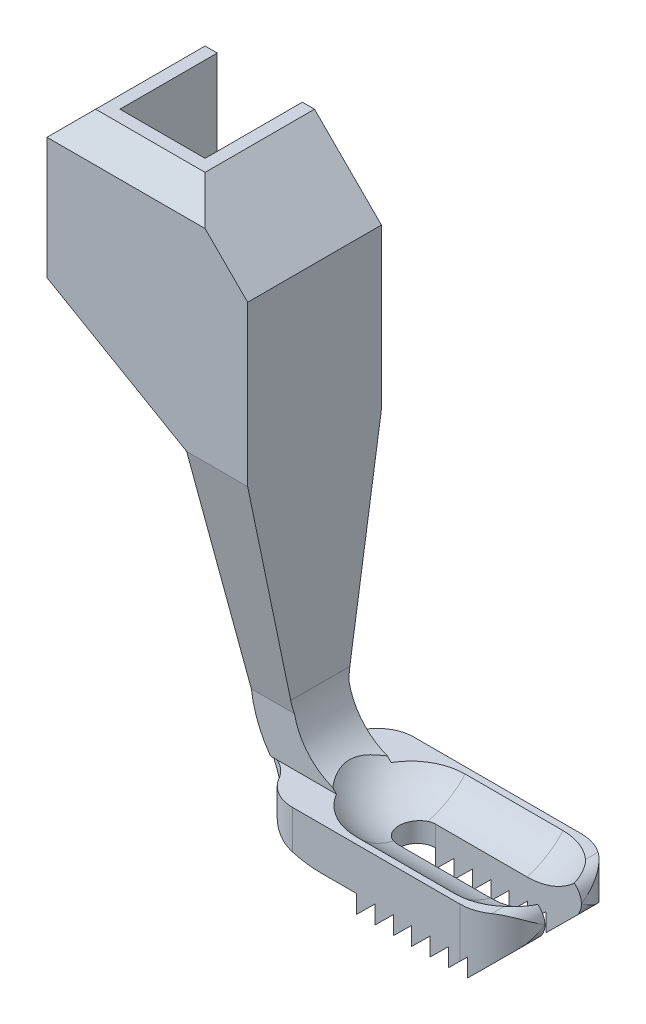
from build123d import *

# Parameters (mm, degrees)
LINEAR_AUSTRAGEN1_DEPTH       = 10
LINEAR_AUSTRAGEN2_DEPTH       = 19.662561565
LINEAR_AUSTRAGEN8_DEPTH       = 19.662561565
LINEAR_AUSTRAGEN9_DEPTH       = 2.25
LINEAR_AUSTRAGEN9_DEPTH_BACK  = 2.25
LINEAR_AUSTRAGEN10_DEPTH      = 5.5
LINEAR_AUSTRAGEN10_DEPTH_BACK = 5.5
LINEAR_AUSTRAGEN11_DEPTH      = 43.285727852
LINEAR_AUSTRAGEN11_DEPTH_BACK = 43.285727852
SKIZZE13_W                    = 7
SKIZZE13_H                    = 8
LINEAR_AUSTRAGEN13_DEPTH      = 52.625327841
FASE1_SIZE                    = 2


with BuildPart() as part:
    # Skizze1 → Linear austragen1 (new body)
    with BuildSketch(Plane.XY):
        with BuildLine():
            Line((0, -8.5), (2.942931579, -8.5))
            Line((2.942931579, -8.5), (2.942931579, -10))
            Line((2.942931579, -10), (4.458843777, -8.5))
            Line((4.458843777, -8.5), (4.458843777, -10))
            Line((4.458843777, -10), (5.974755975, -8.5))
            Line((5.974755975, -8.5), (5.974755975, -10))
            Line((5.974755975, -10), (7.490668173, -8.5))
            Line((7.490668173, -8.5), (7.490668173, -10))
            Line((7.490668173, -10), (9.006580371, -8.5))
            Line((9.006580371, -8.5), (9.006580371, -10))
            Line((9.006580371, -10), (10.522492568, -8.5))
            Line((10.522492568, -8.5), (10.522492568, -10))
            Line((10.522492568, -10), (12.038404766, -8.5))
            Line((12.038404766, -8.5), (12.038404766, -10))
            Line((12.038404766, -10), (14.497980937, -7.566241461))
            ThreePointArc((14.497980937, -7.566241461), (14.830260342, -5.929632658), (13.442931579, -5))
            Line((13.442931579, -5), (0, -5))
            Line((0, -5), (-6.873863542, -5))
            ThreePointArc((-6.873863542, -5), (-3.856812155, -7.574628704), (0, -8.5))
        make_face()
    extrude(amount=LINEAR_AUSTRAGEN1_DEPTH)

    # Skizze2 → Linear austragen2 (cut, through all)
    with BuildSketch(Plane(origin=(0, -5, 0), x_dir=(1, 0, 0), z_dir=(0, 1, 0))):
        with BuildLine():
            Line((14.942931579, -3.5), (2.942931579, -3.5))
            ThreePointArc((2.942931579, -3.5), (1.442931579, -5), (2.942931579, -6.5))
            Line((2.942931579, -6.5), (14.942931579, -6.5))
            Line((14.942931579, -6.5), (14.942931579, -3.5))
        make_face()
    extrude(amount=-LINEAR_AUSTRAGEN2_DEPTH, mode=Mode.SUBTRACT)

    # Skizze3 → Linear austragen8 (cut, through all)
    with BuildSketch(Plane(origin=(0, -5, 0), x_dir=(1, 0, 0), z_dir=(0, 1, 0))):
        with BuildLine():
            Line((14.942931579, 0), (14.942931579, -3.5))
            ThreePointArc((14.942931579, -3.5), (13.917805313, -1.025126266), (11.442931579, 0))
            Line((11.442931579, 0), (14.942931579, 0))
        make_face()
        with BuildLine():
            Line((-6.873863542, -10), (-6.873863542, -7.070666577))
            ThreePointArc((-6.873863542, -7.070666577), (-5.748072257, -7.58005697), (-4.923093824, -8.5))
            ThreePointArc((-4.923093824, -8.5), (-3.825017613, -9.598076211), (-2.325017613, -10))
            Line((-2.325017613, -10), (-6.873863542, -10))
        make_face()
        with BuildLine():
            Line((14.942931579, -10), (11.442931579, -10))
            ThreePointArc((11.442931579, -10), (13.917805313, -8.974873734), (14.942931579, -6.5))
            Line((14.942931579, -6.5), (14.942931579, -10))
        make_face()
        with BuildLine():
            Line((-2.325017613, 0), (-6.873863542, 0))
            Line((-6.873863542, 0), (-6.873863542, -2.929333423))
            ThreePointArc((-6.873863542, -2.929333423), (-5.748072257, -2.41994303), (-4.923093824, -1.5))
            ThreePointArc((-4.923093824, -1.5), (-3.825017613, -0.401923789), (-2.325017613, 0))
        make_face()
    extrude(amount=-LINEAR_AUSTRAGEN8_DEPTH, mode=Mode.SUBTRACT)

    # Skizze5 → Linear austragen9 (add, two sides: drawn at the far end of the back side and taken through both)
    with BuildSketch(Plane.XY.offset(5).offset(-LINEAR_AUSTRAGEN9_DEPTH_BACK)):
        with BuildLine():
            Line((0, -5), (-6.873863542, -5))
            ThreePointArc((-6.873863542, -5), (-7.914293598, -3.100638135), (-8.440971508, -1))
            Line((-8.440971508, -1), (-4.898979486, -1))
            ThreePointArc((-4.898979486, -1), (-3.16227766, -3.872983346), (0, -5))
        make_face()
    extrude(amount=LINEAR_AUSTRAGEN9_DEPTH + LINEAR_AUSTRAGEN9_DEPTH_BACK)

    # Skizze7 → Linear austragen10 (add, two sides: drawn at the far end of the back side and taken through both)
    with BuildSketch(Plane(origin=(0, 0, 5.5), x_dir=(-1, 0, 0), z_dir=(0, 0, -1)).offset(-LINEAR_AUSTRAGEN10_DEPTH_BACK)):
        with BuildLine():
            Line((5, 30.128110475), (5, 0))
            ThreePointArc((5, 0), (4.974680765, -0.50254481), (4.898979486, -1))
            Line((4.898979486, -1), (8.440971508, -1))
            ThreePointArc((8.440971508, -1), (8.455306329, -0.870514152), (8.467654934, -0.740823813))
            Line((8.467654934, -0.740823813), (10.019775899, 17))
            Line((10.019775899, 17), (21.5, 23.628110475))
            Line((21.5, 23.628110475), (21.5, 35.628110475))
            Line((21.5, 35.628110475), (10.5, 35.628110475))
            Line((10.5, 35.628110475), (5, 30.128110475))
        make_face()
    extrude(amount=LINEAR_AUSTRAGEN10_DEPTH + LINEAR_AUSTRAGEN10_DEPTH_BACK)

    # Skizze9 → Linear austragen11 (cut, two sides: drawn at the far end of the back side and taken through both)
    with BuildSketch(Plane(origin=(-5, 0, 0), x_dir=(0, 0, -1), z_dir=(1, 0, 0)).offset(-LINEAR_AUSTRAGEN11_DEPTH_BACK)):
        Polygon((-7.25, -1), (-11, 17), (-11, -1), align=None)
        Polygon((0, 17), (-2.75, -1), (0, -1), align=None)
    extrude(amount=LINEAR_AUSTRAGEN11_DEPTH + LINEAR_AUSTRAGEN11_DEPTH_BACK, mode=Mode.SUBTRACT)

    # Skizze13 → Linear austragen13 (cut, through all)
    with BuildSketch(Plane(origin=(0, 35.628110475, 0), x_dir=(1, 0, 0), z_dir=(0, 1, 0))):
        with Locations((-15, -4)):
            Rectangle(SKIZZE13_W, SKIZZE13_H)
    extrude(amount=-LINEAR_AUSTRAGEN13_DEPTH, mode=Mode.SUBTRACT)

    # Fase1
    fase1_edges = [part.edges().sort_by_distance(p)[0] for p in [
        (-16, 35.628110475, 11),
        (-21.5, 35.628110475, 5.5),
    ]]
    chamfer(fase1_edges, length=FASE1_SIZE)

    # Skizze14 → Schnitt-Rotation1 (revolve, cut)
    with BuildSketch(Plane.XY.offset(5)):
        with BuildLine():
            Line((2.415067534, -7), (10.470795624, -7))
            ThreePointArc((10.470795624, -7), (14.713436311, -5.242640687), (16.470795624, -1))
            Line((16.470795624, -1), (-3.584932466, -1))
            ThreePointArc((-3.584932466, -1), (-1.827573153, -5.242640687), (2.415067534, -7))
        make_face()
    revolve(axis=Axis((2.415067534, -1, 5), (1, 0, 0)), mode=Mode.SUBTRACT)


solid = part.part
